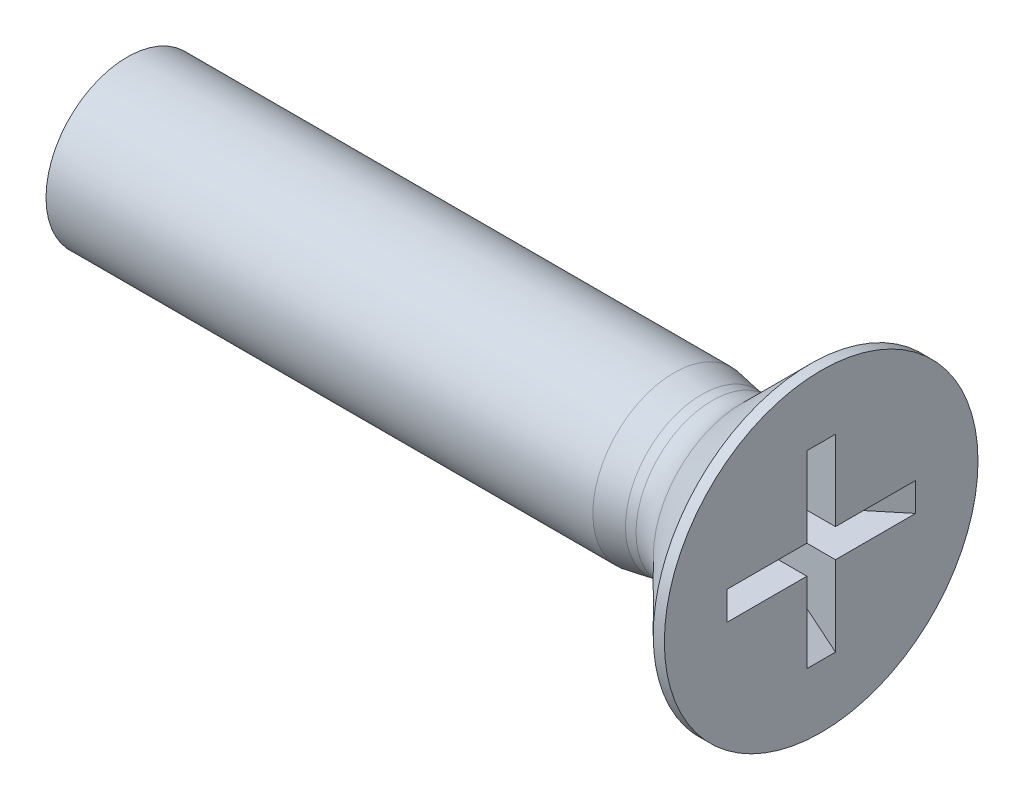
ISO-10303-21;
HEADER;
FILE_DESCRIPTION(('STEP AP214'),'2;1');
FILE_NAME('part.step','',(''),(''),'','','');
FILE_SCHEMA(('AUTOMOTIVE_DESIGN { 1 0 10303 214 1 1 1 1 }'));
ENDSEC;
DATA;
#1=APPLICATION_CONTEXT('core data for automotive mechanical design processes');
#2=APPLICATION_PROTOCOL_DEFINITION('international standard','automotive_design',2000,#1);
#3=PRODUCT_CONTEXT('',#1,'mechanical');
#4=PRODUCT('Part','Part','',(#3));
#5=PRODUCT_RELATED_PRODUCT_CATEGORY('part','',(#4));
#6=PRODUCT_DEFINITION_FORMATION('','',#4);
#7=PRODUCT_DEFINITION_CONTEXT('part definition',#1,'design');
#8=PRODUCT_DEFINITION('design','',#6,#7);
#9=PRODUCT_DEFINITION_SHAPE('','',#8);
#10=(LENGTH_UNIT() NAMED_UNIT(*) SI_UNIT(.MILLI.,.METRE.));
#11=(NAMED_UNIT(*) PLANE_ANGLE_UNIT() SI_UNIT($,.RADIAN.));
#12=(NAMED_UNIT(*) SI_UNIT($,.STERADIAN.) SOLID_ANGLE_UNIT());
#13=UNCERTAINTY_MEASURE_WITH_UNIT(LENGTH_MEASURE(1.E-05),#10,'distance_accuracy_value','');
#14=(GEOMETRIC_REPRESENTATION_CONTEXT(3) GLOBAL_UNCERTAINTY_ASSIGNED_CONTEXT((#13)) GLOBAL_UNIT_ASSIGNED_CONTEXT((#10,
#11,#12)) REPRESENTATION_CONTEXT('',''));
#15=CARTESIAN_POINT('',(0.,0.,0.));
#16=DIRECTION('',(0.,0.,1.));
#17=DIRECTION('',(1.,0.,0.));
#18=AXIS2_PLACEMENT_3D('',#15,#16,#17);
#19=CARTESIAN_POINT('',(-3.5,0.,0.515));
#20=DIRECTION('',(1.,0.,0.));
#21=DIRECTION('',(0.,0.,-1.));
#22=AXIS2_PLACEMENT_3D('',#19,#20,#21);
#23=PLANE('',#22);
#24=DIRECTION('',(0.,0.,1.));
#25=VECTOR('',#24,1.);
#26=CARTESIAN_POINT('',(-3.5,-0.515,0.));
#27=LINE('',#26,#25);
#28=CARTESIAN_POINT('',(-3.5,-0.515,-0.515));
#29=VERTEX_POINT('',#28);
#30=CARTESIAN_POINT('',(-3.50000000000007,-0.515,0.51500000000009));
#31=VERTEX_POINT('',#30);
#32=EDGE_CURVE('E81',#29,#31,#27,.T.);
#33=ORIENTED_EDGE('',*,*,#32,.F.);
#34=DIRECTION('',(0.,1.,0.));
#35=VECTOR('',#34,1.);
#36=CARTESIAN_POINT('',(-3.5,0.,-0.515));
#37=LINE('',#36,#35);
#38=CARTESIAN_POINT('',(-3.50000000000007,0.51500000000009,-0.515));
#39=VERTEX_POINT('',#38);
#40=EDGE_CURVE('E78',#39,#29,#37,.F.);
#41=ORIENTED_EDGE('',*,*,#40,.F.);
#42=DIRECTION('',(0.,0.,1.));
#43=VECTOR('',#42,1.);
#44=CARTESIAN_POINT('',(-3.5000000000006,0.515000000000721,0.));
#45=LINE('',#44,#43);
#46=CARTESIAN_POINT('',(-3.50000000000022,0.515000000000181,0.51500000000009));
#47=VERTEX_POINT('',#46);
#48=EDGE_CURVE('E124',#47,#39,#45,.F.);
#49=ORIENTED_EDGE('',*,*,#48,.F.);
#50=DIRECTION('',(0.,1.,0.));
#51=VECTOR('',#50,1.);
#52=CARTESIAN_POINT('',(-3.5000000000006,0.,0.515000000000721));
#53=LINE('',#52,#51);
#54=EDGE_CURVE('E84',#31,#47,#53,.T.);
#55=ORIENTED_EDGE('',*,*,#54,.F.);
#56=EDGE_LOOP('',(#33,#41,#49,#55));
#57=FACE_BOUND('',#56,.T.);
#58=ADVANCED_FACE('F16',(#57),#23,.T.);
#59=CARTESIAN_POINT('',(-3.5,-0.515,0.));
#60=DIRECTION('',(0.636054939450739,0.771643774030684,0.));
#61=DIRECTION('',(-0.771643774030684,0.636054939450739,0.));
#62=AXIS2_PLACEMENT_3D('',#59,#60,#61);
#63=PLANE('',#62);
#64=DIRECTION('',(-0.771643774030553,0.636054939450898,0.));
#65=VECTOR('',#64,1.);
#66=CARTESIAN_POINT('',(0.,-3.4,0.515));
#67=LINE('',#66,#65);
#68=CARTESIAN_POINT('',(2.97343721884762E-13,-3.39999999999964,0.515));
#69=VERTEX_POINT('',#68);
#70=EDGE_CURVE('E96',#69,#31,#67,.T.);
#71=ORIENTED_EDGE('',*,*,#70,.F.);
#72=DIRECTION('',(0.,0.,1.));
#73=VECTOR('',#72,1.);
#74=CARTESIAN_POINT('',(5.95443833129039E-13,-3.39999999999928,0.));
#75=LINE('',#74,#73);
#76=CARTESIAN_POINT('',(2.97351460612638E-13,-3.39999999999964,-0.515));
#77=VERTEX_POINT('',#76);
#78=EDGE_CURVE('E87',#69,#77,#75,.F.);
#79=ORIENTED_EDGE('',*,*,#78,.T.);
#80=DIRECTION('',(-0.771643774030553,0.636054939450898,0.));
#81=VECTOR('',#80,1.);
#82=CARTESIAN_POINT('',(0.,-3.4,-0.515));
#83=LINE('',#82,#81);
#84=EDGE_CURVE('E90',#77,#29,#83,.T.);
#85=ORIENTED_EDGE('',*,*,#84,.T.);
#86=ORIENTED_EDGE('',*,*,#32,.T.);
#87=EDGE_LOOP('',(#71,#79,#85,#86));
#88=FACE_BOUND('',#87,.T.);
#89=ADVANCED_FACE('F91',(#88),#63,.T.);
#90=CARTESIAN_POINT('',(-3.5,0.,-0.515));
#91=DIRECTION('',(0.636054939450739,0.,0.771643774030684));
#92=DIRECTION('',(0.771643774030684,0.,-0.636054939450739));
#93=AXIS2_PLACEMENT_3D('',#90,#91,#92);
#94=PLANE('',#93);
#95=DIRECTION('',(-0.771643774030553,0.,0.636054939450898));
#96=VECTOR('',#95,1.);
#97=CARTESIAN_POINT('',(0.,-0.515,-3.4));
#98=LINE('',#97,#96);
#99=CARTESIAN_POINT('',(2.973475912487E-13,-0.515,-3.39999999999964));
#100=VERTEX_POINT('',#99);
#101=EDGE_CURVE('E95',#100,#29,#98,.T.);
#102=ORIENTED_EDGE('',*,*,#101,.F.);
#103=DIRECTION('',(0.,1.,0.));
#104=VECTOR('',#103,1.);
#105=CARTESIAN_POINT('',(5.95443833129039E-13,0.,-3.39999999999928));
#106=LINE('',#105,#104);
#107=CARTESIAN_POINT('',(2.973475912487E-13,0.515,-3.39999999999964));
#108=VERTEX_POINT('',#107);
#109=EDGE_CURVE('E106',#100,#108,#106,.T.);
#110=ORIENTED_EDGE('',*,*,#109,.T.);
#111=DIRECTION('',(-0.771643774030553,0.,0.636054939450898));
#112=VECTOR('',#111,1.);
#113=CARTESIAN_POINT('',(0.,0.515,-3.4));
#114=LINE('',#113,#112);
#115=EDGE_CURVE('E104',#108,#39,#114,.T.);
#116=ORIENTED_EDGE('',*,*,#115,.T.);
#117=ORIENTED_EDGE('',*,*,#40,.T.);
#118=EDGE_LOOP('',(#102,#110,#116,#117));
#119=FACE_BOUND('',#118,.T.);
#120=ADVANCED_FACE('F100',(#119),#94,.T.);
#121=CARTESIAN_POINT('',(0.,3.4,0.));
#122=DIRECTION('',(0.636054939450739,-0.771643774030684,0.));
#123=DIRECTION('',(0.771643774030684,0.636054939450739,0.));
#124=AXIS2_PLACEMENT_3D('',#121,#122,#123);
#125=PLANE('',#124);
#126=DIRECTION('',(0.771643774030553,0.636054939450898,0.));
#127=VECTOR('',#126,1.);
#128=CARTESIAN_POINT('',(-3.5,0.515,0.515));
#129=LINE('',#128,#127);
#130=CARTESIAN_POINT('',(0.,3.4,0.515));
#131=VERTEX_POINT('',#130);
#132=EDGE_CURVE('E177',#47,#131,#129,.T.);
#133=ORIENTED_EDGE('',*,*,#132,.F.);
#134=ORIENTED_EDGE('',*,*,#48,.T.);
#135=DIRECTION('',(0.771643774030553,0.636054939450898,0.));
#136=VECTOR('',#135,1.);
#137=CARTESIAN_POINT('',(-3.5,0.515,-0.515));
#138=LINE('',#137,#136);
#139=CARTESIAN_POINT('',(0.,3.4,-0.515));
#140=VERTEX_POINT('',#139);
#141=EDGE_CURVE('E183',#39,#140,#138,.T.);
#142=ORIENTED_EDGE('',*,*,#141,.T.);
#143=DIRECTION('',(0.,0.,1.));
#144=VECTOR('',#143,1.);
#145=CARTESIAN_POINT('',(0.,3.4,0.));
#146=LINE('',#145,#144);
#147=EDGE_CURVE('E126',#140,#131,#146,.T.);
#148=ORIENTED_EDGE('',*,*,#147,.T.);
#149=EDGE_LOOP('',(#133,#134,#142,#148));
#150=FACE_BOUND('',#149,.T.);
#151=ADVANCED_FACE('F188',(#150),#125,.T.);
#152=CARTESIAN_POINT('',(0.,0.,3.4));
#153=DIRECTION('',(0.636054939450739,0.,-0.771643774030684));
#154=DIRECTION('',(-0.771643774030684,0.,-0.636054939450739));
#155=AXIS2_PLACEMENT_3D('',#152,#153,#154);
#156=PLANE('',#155);
#157=DIRECTION('',(0.771643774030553,0.,0.636054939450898));
#158=VECTOR('',#157,1.);
#159=CARTESIAN_POINT('',(-3.5,-0.515,0.515));
#160=LINE('',#159,#158);
#161=CARTESIAN_POINT('',(0.,-0.515,3.4));
#162=VERTEX_POINT('',#161);
#163=EDGE_CURVE('E170',#31,#162,#160,.T.);
#164=ORIENTED_EDGE('',*,*,#163,.F.);
#165=ORIENTED_EDGE('',*,*,#54,.T.);
#166=DIRECTION('',(0.771643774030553,0.,0.636054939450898));
#167=VECTOR('',#166,1.);
#168=CARTESIAN_POINT('',(-3.5,0.515,0.515));
#169=LINE('',#168,#167);
#170=CARTESIAN_POINT('',(0.,0.515,3.4));
#171=VERTEX_POINT('',#170);
#172=EDGE_CURVE('E175',#47,#171,#169,.T.);
#173=ORIENTED_EDGE('',*,*,#172,.T.);
#174=DIRECTION('',(0.,1.,0.));
#175=VECTOR('',#174,1.);
#176=CARTESIAN_POINT('',(0.,0.,3.4));
#177=LINE('',#176,#175);
#178=EDGE_CURVE('E34',#171,#162,#177,.F.);
#179=ORIENTED_EDGE('',*,*,#178,.T.);
#180=EDGE_LOOP('',(#164,#165,#173,#179));
#181=FACE_BOUND('',#180,.T.);
#182=ADVANCED_FACE('F205',(#181),#156,.T.);
#183=CARTESIAN_POINT('',(0.,0.,0.515));
#184=DIRECTION('',(0.,0.,-1.));
#185=DIRECTION('',(0.,1.,0.));
#186=AXIS2_PLACEMENT_3D('',#183,#184,#185);
#187=PLANE('',#186);
#188=ORIENTED_EDGE('',*,*,#70,.T.);
#189=DIRECTION('',(1.,0.,0.));
#190=VECTOR('',#189,1.);
#191=CARTESIAN_POINT('',(0.,-0.515,0.515));
#192=LINE('',#191,#190);
#193=CARTESIAN_POINT('',(0.,-0.515,0.515));
#194=VERTEX_POINT('',#193);
#195=EDGE_CURVE('E165',#194,#31,#192,.F.);
#196=ORIENTED_EDGE('',*,*,#195,.F.);
#197=DIRECTION('',(0.,1.,0.));
#198=VECTOR('',#197,1.);
#199=CARTESIAN_POINT('',(0.,0.,0.515));
#200=LINE('',#199,#198);
#201=EDGE_CURVE('E162',#194,#69,#200,.F.);
#202=ORIENTED_EDGE('',*,*,#201,.T.);
#203=EDGE_LOOP('',(#188,#196,#202));
#204=FACE_BOUND('',#203,.T.);
#205=ADVANCED_FACE('F209',(#204),#187,.T.);
#206=CARTESIAN_POINT('',(0.,0.,-0.515));
#207=DIRECTION('',(0.,0.,-1.));
#208=DIRECTION('',(0.,1.,0.));
#209=AXIS2_PLACEMENT_3D('',#206,#207,#208);
#210=PLANE('',#209);
#211=ORIENTED_EDGE('',*,*,#84,.F.);
#212=DIRECTION('',(0.,1.,0.));
#213=VECTOR('',#212,1.);
#214=CARTESIAN_POINT('',(0.,0.,-0.515));
#215=LINE('',#214,#213);
#216=CARTESIAN_POINT('',(0.,-0.515,-0.515));
#217=VERTEX_POINT('',#216);
#218=EDGE_CURVE('E111',#77,#217,#215,.T.);
#219=ORIENTED_EDGE('',*,*,#218,.T.);
#220=DIRECTION('',(1.,0.,0.));
#221=VECTOR('',#220,1.);
#222=CARTESIAN_POINT('',(0.,-0.515,-0.515));
#223=LINE('',#222,#221);
#224=EDGE_CURVE('E109',#29,#217,#223,.T.);
#225=ORIENTED_EDGE('',*,*,#224,.F.);
#226=EDGE_LOOP('',(#211,#219,#225));
#227=FACE_BOUND('',#226,.T.);
#228=ADVANCED_FACE('F110',(#227),#210,.F.);
#229=CARTESIAN_POINT('',(0.,-0.515,0.));
#230=DIRECTION('',(0.,1.,0.));
#231=DIRECTION('',(0.,0.,1.));
#232=AXIS2_PLACEMENT_3D('',#229,#230,#231);
#233=PLANE('',#232);
#234=ORIENTED_EDGE('',*,*,#101,.T.);
#235=ORIENTED_EDGE('',*,*,#224,.T.);
#236=DIRECTION('',(0.,0.,1.));
#237=VECTOR('',#236,1.);
#238=CARTESIAN_POINT('',(0.,-0.515,0.));
#239=LINE('',#238,#237);
#240=EDGE_CURVE('E116',#217,#100,#239,.F.);
#241=ORIENTED_EDGE('',*,*,#240,.T.);
#242=EDGE_LOOP('',(#234,#235,#241));
#243=FACE_BOUND('',#242,.T.);
#244=ADVANCED_FACE('F115',(#243),#233,.T.);
#245=CARTESIAN_POINT('',(0.,0.515,0.));
#246=DIRECTION('',(0.,1.,0.));
#247=DIRECTION('',(0.,0.,1.));
#248=AXIS2_PLACEMENT_3D('',#245,#246,#247);
#249=PLANE('',#248);
#250=ORIENTED_EDGE('',*,*,#115,.F.);
#251=DIRECTION('',(0.,0.,1.));
#252=VECTOR('',#251,1.);
#253=CARTESIAN_POINT('',(0.,0.515,0.));
#254=LINE('',#253,#252);
#255=CARTESIAN_POINT('',(0.,0.515,-0.515));
#256=VERTEX_POINT('',#255);
#257=EDGE_CURVE('E158',#108,#256,#254,.T.);
#258=ORIENTED_EDGE('',*,*,#257,.T.);
#259=DIRECTION('',(1.,0.,0.));
#260=VECTOR('',#259,1.);
#261=CARTESIAN_POINT('',(0.,0.515,-0.515));
#262=LINE('',#261,#260);
#263=EDGE_CURVE('E180',#256,#39,#262,.F.);
#264=ORIENTED_EDGE('',*,*,#263,.T.);
#265=EDGE_LOOP('',(#250,#258,#264));
#266=FACE_BOUND('',#265,.T.);
#267=ADVANCED_FACE('F213',(#266),#249,.F.);
#268=CARTESIAN_POINT('',(0.,0.,-0.515));
#269=DIRECTION('',(0.,0.,-1.));
#270=DIRECTION('',(0.,1.,0.));
#271=AXIS2_PLACEMENT_3D('',#268,#269,#270);
#272=PLANE('',#271);
#273=DIRECTION('',(0.,1.,0.));
#274=VECTOR('',#273,1.);
#275=CARTESIAN_POINT('',(0.,0.,-0.515));
#276=LINE('',#275,#274);
#277=EDGE_CURVE('E155',#256,#140,#276,.T.);
#278=ORIENTED_EDGE('',*,*,#277,.T.);
#279=ORIENTED_EDGE('',*,*,#141,.F.);
#280=ORIENTED_EDGE('',*,*,#263,.F.);
#281=EDGE_LOOP('',(#278,#279,#280));
#282=FACE_BOUND('',#281,.T.);
#283=ADVANCED_FACE('F192',(#282),#272,.F.);
#284=CARTESIAN_POINT('',(0.,0.,0.515));
#285=DIRECTION('',(0.,0.,-1.));
#286=DIRECTION('',(0.,1.,0.));
#287=AXIS2_PLACEMENT_3D('',#284,#285,#286);
#288=PLANE('',#287);
#289=DIRECTION('',(0.,1.,0.));
#290=VECTOR('',#289,1.);
#291=CARTESIAN_POINT('',(0.,0.,0.515));
#292=LINE('',#291,#290);
#293=CARTESIAN_POINT('',(0.,0.515,0.515));
#294=VERTEX_POINT('',#293);
#295=EDGE_CURVE('E153',#131,#294,#292,.F.);
#296=ORIENTED_EDGE('',*,*,#295,.T.);
#297=DIRECTION('',(1.,0.,0.));
#298=VECTOR('',#297,1.);
#299=CARTESIAN_POINT('',(0.,0.515,0.515));
#300=LINE('',#299,#298);
#301=EDGE_CURVE('E172',#294,#47,#300,.F.);
#302=ORIENTED_EDGE('',*,*,#301,.T.);
#303=ORIENTED_EDGE('',*,*,#132,.T.);
#304=EDGE_LOOP('',(#296,#302,#303));
#305=FACE_BOUND('',#304,.T.);
#306=ADVANCED_FACE('F201',(#305),#288,.T.);
#307=CARTESIAN_POINT('',(0.,0.515,0.));
#308=DIRECTION('',(0.,1.,0.));
#309=DIRECTION('',(0.,0.,1.));
#310=AXIS2_PLACEMENT_3D('',#307,#308,#309);
#311=PLANE('',#310);
#312=DIRECTION('',(0.,0.,1.));
#313=VECTOR('',#312,1.);
#314=CARTESIAN_POINT('',(0.,0.515,0.));
#315=LINE('',#314,#313);
#316=EDGE_CURVE('E150',#294,#171,#315,.T.);
#317=ORIENTED_EDGE('',*,*,#316,.T.);
#318=ORIENTED_EDGE('',*,*,#172,.F.);
#319=ORIENTED_EDGE('',*,*,#301,.F.);
#320=EDGE_LOOP('',(#317,#318,#319));
#321=FACE_BOUND('',#320,.T.);
#322=ADVANCED_FACE('F204',(#321),#311,.F.);
#323=CARTESIAN_POINT('',(0.,-0.515,0.));
#324=DIRECTION('',(0.,1.,0.));
#325=DIRECTION('',(0.,0.,1.));
#326=AXIS2_PLACEMENT_3D('',#323,#324,#325);
#327=PLANE('',#326);
#328=DIRECTION('',(0.,0.,1.));
#329=VECTOR('',#328,1.);
#330=CARTESIAN_POINT('',(0.,-0.515,0.));
#331=LINE('',#330,#329);
#332=EDGE_CURVE('E147',#162,#194,#331,.F.);
#333=ORIENTED_EDGE('',*,*,#332,.T.);
#334=ORIENTED_EDGE('',*,*,#195,.T.);
#335=ORIENTED_EDGE('',*,*,#163,.T.);
#336=EDGE_LOOP('',(#333,#334,#335));
#337=FACE_BOUND('',#336,.T.);
#338=ADVANCED_FACE('F211',(#337),#327,.T.);
#339=CARTESIAN_POINT('',(0.,0.,0.));
#340=DIRECTION('',(-1.,0.,0.));
#341=DIRECTION('',(0.,0.,1.));
#342=AXIS2_PLACEMENT_3D('',#339,#340,#341);
#343=PLANE('',#342);
#344=ORIENTED_EDGE('',*,*,#178,.F.);
#345=ORIENTED_EDGE('',*,*,#316,.F.);
#346=ORIENTED_EDGE('',*,*,#295,.F.);
#347=ORIENTED_EDGE('',*,*,#147,.F.);
#348=ORIENTED_EDGE('',*,*,#277,.F.);
#349=ORIENTED_EDGE('',*,*,#257,.F.);
#350=ORIENTED_EDGE('',*,*,#109,.F.);
#351=ORIENTED_EDGE('',*,*,#240,.F.);
#352=ORIENTED_EDGE('',*,*,#218,.F.);
#353=ORIENTED_EDGE('',*,*,#78,.F.);
#354=ORIENTED_EDGE('',*,*,#201,.F.);
#355=ORIENTED_EDGE('',*,*,#332,.F.);
#356=EDGE_LOOP('',(#344,#345,#346,#347,#348,#349,#350,#351,#352,#353,#354,#355));
#357=FACE_BOUND('',#356,.T.);
#358=CARTESIAN_POINT('',(0.,0.,0.));
#359=DIRECTION('',(-1.,0.,0.));
#360=DIRECTION('',(0.,0.,1.));
#361=AXIS2_PLACEMENT_3D('',#358,#359,#360);
#362=CIRCLE('',#361,5.65);
#363=CARTESIAN_POINT('',(0.,0.,5.65));
#364=VERTEX_POINT('',#363);
#365=EDGE_CURVE('E19',#364,#364,#362,.T.);
#366=ORIENTED_EDGE('',*,*,#365,.F.);
#367=EDGE_LOOP('',(#366));
#368=FACE_BOUND('',#367,.T.);
#369=ADVANCED_FACE('F195',(#357,#368),#343,.F.);
#370=CARTESIAN_POINT('',(-12.5,0.,0.));
#371=DIRECTION('',(-1.,0.,0.));
#372=DIRECTION('',(0.,0.,1.));
#373=AXIS2_PLACEMENT_3D('',#370,#371,#372);
#374=CYLINDRICAL_SURFACE('',#373,5.65);
#375=CARTESIAN_POINT('',(-0.400000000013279,0.,0.));
#376=DIRECTION('',(1.,0.,0.));
#377=DIRECTION('',(0.,0.479425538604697,0.877582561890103));
#378=AXIS2_PLACEMENT_3D('',#375,#376,#377);
#379=CIRCLE('',#378,5.65000000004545);
#380=CARTESIAN_POINT('',(-0.400000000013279,2.70875429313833,4.95834147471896));
#381=VERTEX_POINT('',#380);
#382=EDGE_CURVE('E146',#381,#381,#379,.F.);
#383=ORIENTED_EDGE('',*,*,#382,.F.);
#384=EDGE_LOOP('',(#383));
#385=FACE_BOUND('',#384,.T.);
#386=ORIENTED_EDGE('',*,*,#365,.T.);
#387=EDGE_LOOP('',(#386));
#388=FACE_BOUND('',#387,.T.);
#389=ADVANCED_FACE('F249',(#385,#388),#374,.T.);
#390=CARTESIAN_POINT('',(-0.400000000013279,0.,0.));
#391=DIRECTION('',(1.,0.,0.));
#392=DIRECTION('',(0.,0.,-1.));
#393=AXIS2_PLACEMENT_3D('',#390,#391,#392);
#394=CONICAL_SURFACE('',#393,5.65000000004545,0.785398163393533);
#395=ORIENTED_EDGE('',*,*,#382,.T.);
#396=EDGE_LOOP('',(#395));
#397=FACE_BOUND('',#396,.T.);
#398=CARTESIAN_POINT('',(-2.86066017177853,0.,0.));
#399=DIRECTION('',(1.,0.,0.));
#400=DIRECTION('',(0.,0.479425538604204,0.877582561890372));
#401=AXIS2_PLACEMENT_3D('',#398,#399,#400);
#402=CIRCLE('',#401,3.18933982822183);
#403=CARTESIAN_POINT('',(-2.86066017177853,1.52905096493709,2.79890901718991));
#404=VERTEX_POINT('',#403);
#405=EDGE_CURVE('E139',#404,#404,#402,.T.);
#406=ORIENTED_EDGE('',*,*,#405,.T.);
#407=EDGE_LOOP('',(#406));
#408=FACE_BOUND('',#407,.T.);
#409=ADVANCED_FACE('F245',(#397,#408),#394,.T.);
#410=CARTESIAN_POINT('',(-3.92132034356,0.,0.));
#411=DIRECTION('',(1.,0.,0.));
#412=DIRECTION('',(0.,0.479425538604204,0.877582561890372));
#413=AXIS2_PLACEMENT_3D('',#410,#411,#412);
#414=TOROIDAL_SURFACE('',#413,4.25,1.5);
#415=ORIENTED_EDGE('',*,*,#405,.F.);
#416=EDGE_LOOP('',(#415));
#417=FACE_BOUND('',#416,.T.);
#418=CARTESIAN_POINT('',(-3.92132034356,0.,0.));
#419=DIRECTION('',(-1.,0.,0.));
#420=DIRECTION('',(0.,0.,1.));
#421=AXIS2_PLACEMENT_3D('',#418,#419,#420);
#422=CIRCLE('',#421,2.75);
#423=CARTESIAN_POINT('',(-3.92132034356,0.,2.75));
#424=VERTEX_POINT('',#423);
#425=EDGE_CURVE('E134',#424,#424,#422,.T.);
#426=ORIENTED_EDGE('',*,*,#425,.F.);
#427=EDGE_LOOP('',(#426));
#428=FACE_BOUND('',#427,.T.);
#429=ADVANCED_FACE('F241',(#417,#428),#414,.F.);
#430=CARTESIAN_POINT('',(-12.5,0.,0.));
#431=DIRECTION('',(-1.,0.,0.));
#432=DIRECTION('',(0.,0.,1.));
#433=AXIS2_PLACEMENT_3D('',#430,#431,#432);
#434=CYLINDRICAL_SURFACE('',#433,2.75);
#435=CARTESIAN_POINT('',(-4.30000000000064,0.,0.));
#436=DIRECTION('',(-1.,0.,0.));
#437=DIRECTION('',(0.,0.479425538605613,0.877582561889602));
#438=AXIS2_PLACEMENT_3D('',#435,#436,#437);
#439=CIRCLE('',#438,2.7499999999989);
#440=CARTESIAN_POINT('',(-4.30000000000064,1.31842023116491,2.41335204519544));
#441=VERTEX_POINT('',#440);
#442=EDGE_CURVE('E130',#441,#441,#439,.T.);
#443=ORIENTED_EDGE('',*,*,#442,.F.);
#444=EDGE_LOOP('',(#443));
#445=FACE_BOUND('',#444,.T.);
#446=ORIENTED_EDGE('',*,*,#425,.T.);
#447=EDGE_LOOP('',(#446));
#448=FACE_BOUND('',#447,.T.);
#449=ADVANCED_FACE('F237',(#445,#448),#434,.T.);
#450=CARTESIAN_POINT('',(-25.,0.,2.92682926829));
#451=DIRECTION('',(-1.,0.,0.));
#452=DIRECTION('',(0.,0.,1.));
#453=AXIS2_PLACEMENT_3D('',#450,#451,#452);
#454=PLANE('',#453);
#455=CARTESIAN_POINT('',(-25.,0.,0.));
#456=DIRECTION('',(-1.,0.,0.));
#457=DIRECTION('',(0.,0.,1.));
#458=AXIS2_PLACEMENT_3D('',#455,#456,#457);
#459=CIRCLE('',#458,2.92682926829);
#460=CARTESIAN_POINT('',(-25.,0.,2.92682926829));
#461=VERTEX_POINT('',#460);
#462=EDGE_CURVE('E25',#461,#461,#459,.F.);
#463=ORIENTED_EDGE('',*,*,#462,.F.);
#464=EDGE_LOOP('',(#463));
#465=FACE_BOUND('',#464,.T.);
#466=ADVANCED_FACE('F230',(#465),#454,.T.);
#467=CARTESIAN_POINT('',(-5.2999999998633,0.,0.));
#468=DIRECTION('',(-1.,0.,0.));
#469=DIRECTION('',(0.,0.,1.));
#470=AXIS2_PLACEMENT_3D('',#467,#468,#469);
#471=CONICAL_SURFACE('',#470,2.92682926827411,0.175020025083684);
#472=CARTESIAN_POINT('',(-5.3,0.,0.));
#473=DIRECTION('',(-1.,0.,0.));
#474=DIRECTION('',(0.,0.,1.));
#475=AXIS2_PLACEMENT_3D('',#472,#473,#474);
#476=CIRCLE('',#475,2.92682926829);
#477=CARTESIAN_POINT('',(-5.3,0.,2.92682926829));
#478=VERTEX_POINT('',#477);
#479=EDGE_CURVE('E11',#478,#478,#476,.T.);
#480=ORIENTED_EDGE('',*,*,#479,.F.);
#481=EDGE_LOOP('',(#480));
#482=FACE_BOUND('',#481,.T.);
#483=ORIENTED_EDGE('',*,*,#442,.T.);
#484=EDGE_LOOP('',(#483));
#485=FACE_BOUND('',#484,.T.);
#486=ADVANCED_FACE('F225',(#482,#485),#471,.T.);
#487=CARTESIAN_POINT('',(-12.5,0.,0.));
#488=DIRECTION('',(-1.,0.,0.));
#489=DIRECTION('',(0.,0.,1.));
#490=AXIS2_PLACEMENT_3D('',#487,#488,#489);
#491=CYLINDRICAL_SURFACE('',#490,2.92682926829);
#492=ORIENTED_EDGE('',*,*,#462,.T.);
#493=EDGE_LOOP('',(#492));
#494=FACE_BOUND('',#493,.T.);
#495=ORIENTED_EDGE('',*,*,#479,.T.);
#496=EDGE_LOOP('',(#495));
#497=FACE_BOUND('',#496,.T.);
#498=ADVANCED_FACE('F223',(#494,#497),#491,.T.);
#499=CLOSED_SHELL('',(#58,#89,#120,#151,#182,#205,#228,#244,#267,#283,#306,#322,#338,#369,#389,
#409,#429,#449,#466,#486,#498));
#500=MANIFOLD_SOLID_BREP('B1',#499);
#501=ADVANCED_BREP_SHAPE_REPRESENTATION('',(#18,#500),#14);
#502=SHAPE_DEFINITION_REPRESENTATION(#9,#501);
ENDSEC;
END-ISO-10303-21;
